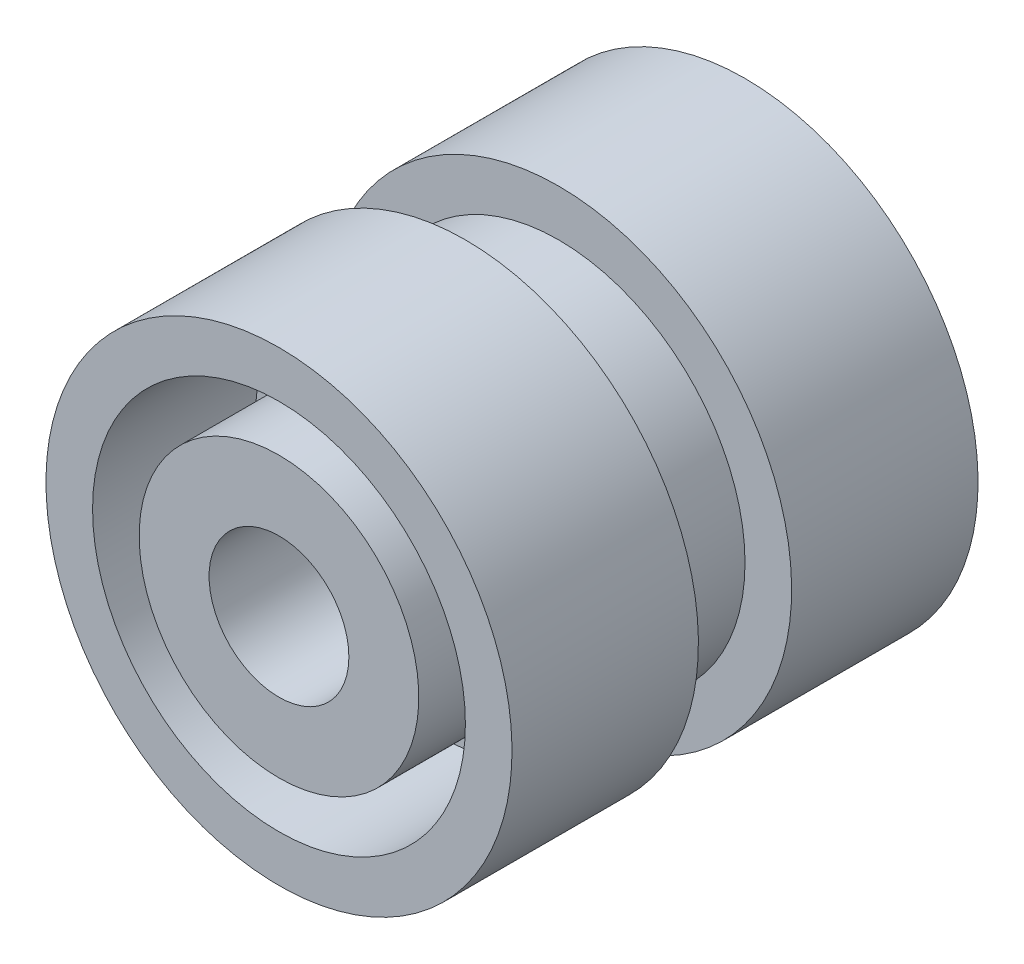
from build123d import *

# Parameters (mm, degrees)
SALIENTE_EXTRUIR1_DEPTH = 2
CROQUIS3_R              = 1.5
CORTAR_EXTRUIR1_DEPTH   = 8


with BuildPart() as part:
    # Croquis1 → Revoluci_n1 (revolve)
    with BuildSketch(Plane(origin=(0, 0, 0), x_dir=(0, 0, -1), z_dir=(1, 0, 0))):
        Polygon((0, 0), (-5, 0), (-5, 3), (-1.5, 3), (-1.5, 4), (-5, 4), (-5, 5), (-1, 5), (-1, 4), (1, 4), (1, 5), (5, 5), (5, 4), (1.5, 4), (1.5, 0), align=None)
    revolve(axis=Axis((0, 0, 0), (0, 0, 1)))

    # Croquis2 → Saliente-Extruir1 (add)
    with BuildSketch(Plane(origin=(0, 0, -1.5), x_dir=(-1, 0, 0), z_dir=(0, 0, -1))):
        with BuildLine():
            ThreePointArc((1.936491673, 0.5), (1.414213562, 1.414213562), (0.5, 1.936491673))
            Line((0.5, 1.936491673), (0.5, 3.968626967))
            ThreePointArc((0.5, 3.968626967), (0, 4), (-0.5, 3.968626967))
            Line((-0.5, 3.968626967), (-0.5, 1.936491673))
            ThreePointArc((-0.5, 1.936491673), (-1.414213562, 1.414213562), (-1.936491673, 0.5))
            Line((-1.936491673, 0.5), (-3.968626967, 0.5))
            ThreePointArc((-3.968626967, 0.5), (-4, 0), (-3.968626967, -0.5))
            Line((-3.968626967, -0.5), (-1.936491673, -0.5))
            ThreePointArc((-1.936491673, -0.5), (-1.414213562, -1.414213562), (-0.5, -1.936491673))
            Line((-0.5, -1.936491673), (-0.5, -3.968626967))
            ThreePointArc((-0.5, -3.968626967), (0, -4), (0.5, -3.968626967))
            Line((0.5, -3.968626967), (0.5, -1.936491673))
            ThreePointArc((0.5, -1.936491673), (1.414213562, -1.414213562), (1.936491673, -0.5))
            Line((1.936491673, -0.5), (3.968626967, -0.5))
            ThreePointArc((3.968626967, -0.5), (3.992149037, -0.25049165), (4, 0))
            ThreePointArc((4, 0), (3.992149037, 0.25049165), (3.968626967, 0.5))
            Line((3.968626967, 0.5), (1.936491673, 0.5))
        make_face()
    extrude(amount=SALIENTE_EXTRUIR1_DEPTH)

    # Croquis3 → Cortar-Extruir1 (cut)
    with BuildSketch(Plane.XY.offset(5)):
        Circle(CROQUIS3_R)
    extrude(amount=-CORTAR_EXTRUIR1_DEPTH, mode=Mode.SUBTRACT)


solid = part.part
